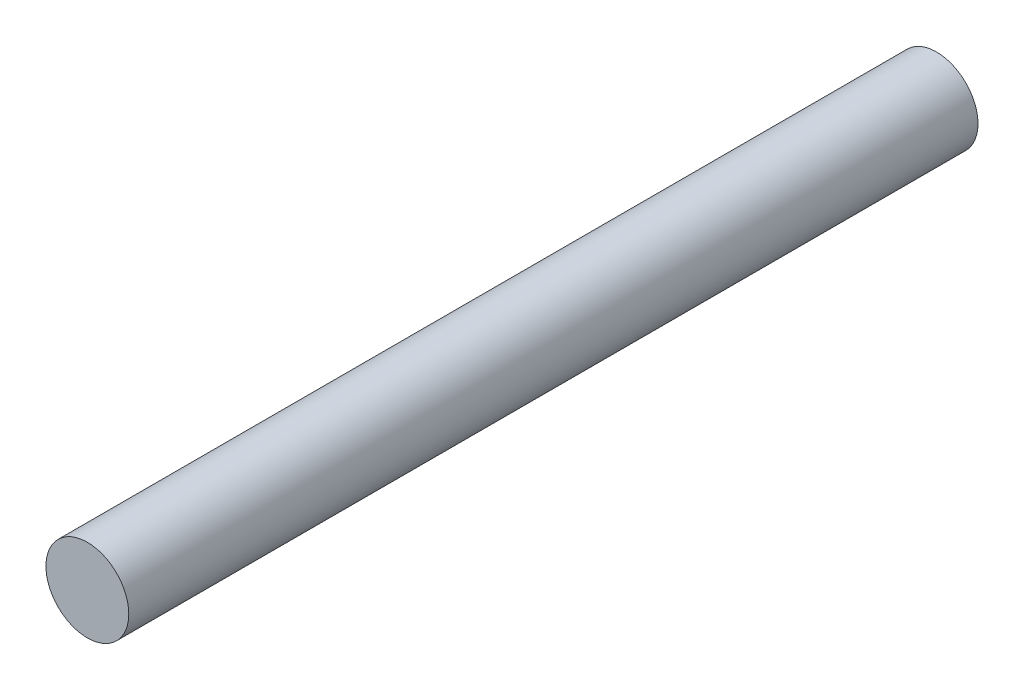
from build123d import *

# Parameters (mm, degrees)
SKETCH1_R           = 4
BOSS_EXTRUDE1_DEPTH = 82


with BuildPart() as part:
    # Sketch1 → Boss-Extrude1 (new body)
    with BuildSketch(Plane.XY):
        Circle(SKETCH1_R)
    extrude(amount=BOSS_EXTRUDE1_DEPTH)


solid = part.part
